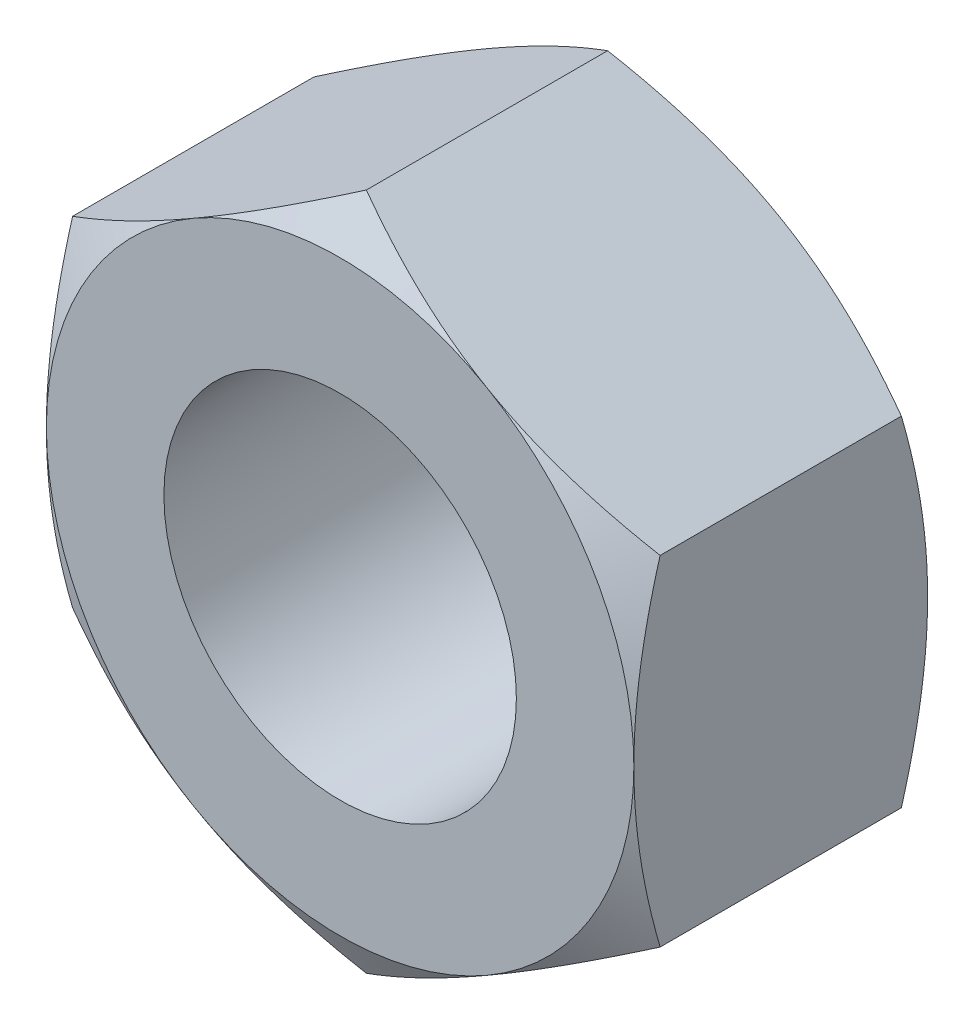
from build123d import *

# Parameters (mm, degrees)
BASE_EXTRUSION_DEPTH    = 5
ESQUISSE3_R             = 3
ENL_V_MAT_EXTRU_1_DEPTH = 10.128709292


with BuildPart() as part:
    # Esquisse1 → Base-Extrusion (new body)
    with BuildSketch(Plane.XY):
        Polygon((5, -2.886751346), (5, 2.886751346), (0, 5.773502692), (-5, 2.886751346), (-5, -2.886751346), (0, -5.773502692), align=None)
    extrude(amount=-BASE_EXTRUSION_DEPTH)

    # Esquisse2 → Enl_vement de mati_re-R_volution1 (revolve, cut)
    with BuildSketch(Plane(origin=(0, 0, 0), x_dir=(1, 0, 0), z_dir=(0, 1, 0)), mode=Mode.PRIVATE) as enl_vement_de_mati_re_r_volution1_sk:
        Polygon((-5, 0), (-10.330127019, 0), (-10.330127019, 5), (-5, 5), (-9.330127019, 2.5), align=None)
    revolve(enl_vement_de_mati_re_r_volution1_sk.sketch.rotate(Axis((0, 0, -5), (0, 0, 1)), 180), axis=Axis((0, 0, -5), (0, 0, 1)), mode=Mode.SUBTRACT)

    # Esquisse3 → Enl_v. mat.-Extru.1 (cut, through all)
    with BuildSketch(Plane.XY):
        Circle(ESQUISSE3_R)
    extrude(amount=-ENL_V_MAT_EXTRU_1_DEPTH, mode=Mode.SUBTRACT)


solid = part.part
